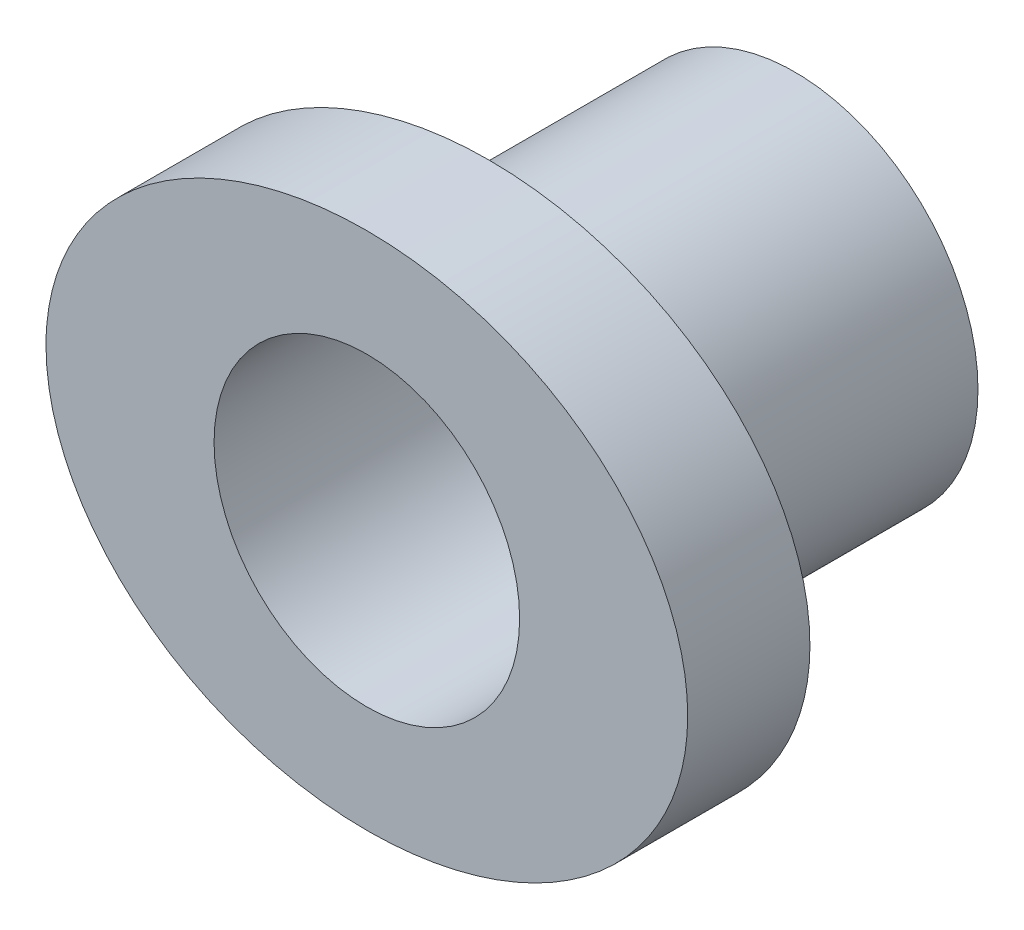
from build123d import *
from build123d.topology import SkipClean

# Parameters (mm, degrees)
SKETCH1_RX          = 5.25
SKETCH1_RY          = 4.25
SKETCH1_R           = 2.5
BOSS_EXTRUDE1_DEPTH = 2
BOSS_EXTRUDE2_START = 5
SKETCH2_R           = 3
SKETCH2_R_2         = 2.5
BOSS_EXTRUDE2_DEPTH = 5


with BuildPart() as part:
    # Sketch1 → Boss-Extrude1 (new body)
    with BuildSketch(Plane.XY):
        with Locations(Location((0, 0), (0, 0, 180))):
            Ellipse(SKETCH1_RX, SKETCH1_RY)
        Circle(SKETCH1_R, mode=Mode.SUBTRACT)
    extrude(amount=BOSS_EXTRUDE1_DEPTH)

    # Sketch2 → Boss-Extrude2 (add)
    with SkipClean():  # the faces are left unmerged after this step: merging them gives an invalid solid
        with BuildSketch(Plane(origin=(0, 0, 0), x_dir=(-1, 0, 0), z_dir=(0, 0, -1)).offset(BOSS_EXTRUDE2_START)):
            with Locations(Location((0, 0, 0), (0, 0, 180))):
                Circle(SKETCH2_R)
            Circle(SKETCH2_R_2, mode=Mode.SUBTRACT)
        extrude(amount=-BOSS_EXTRUDE2_DEPTH)


solid = part.part
